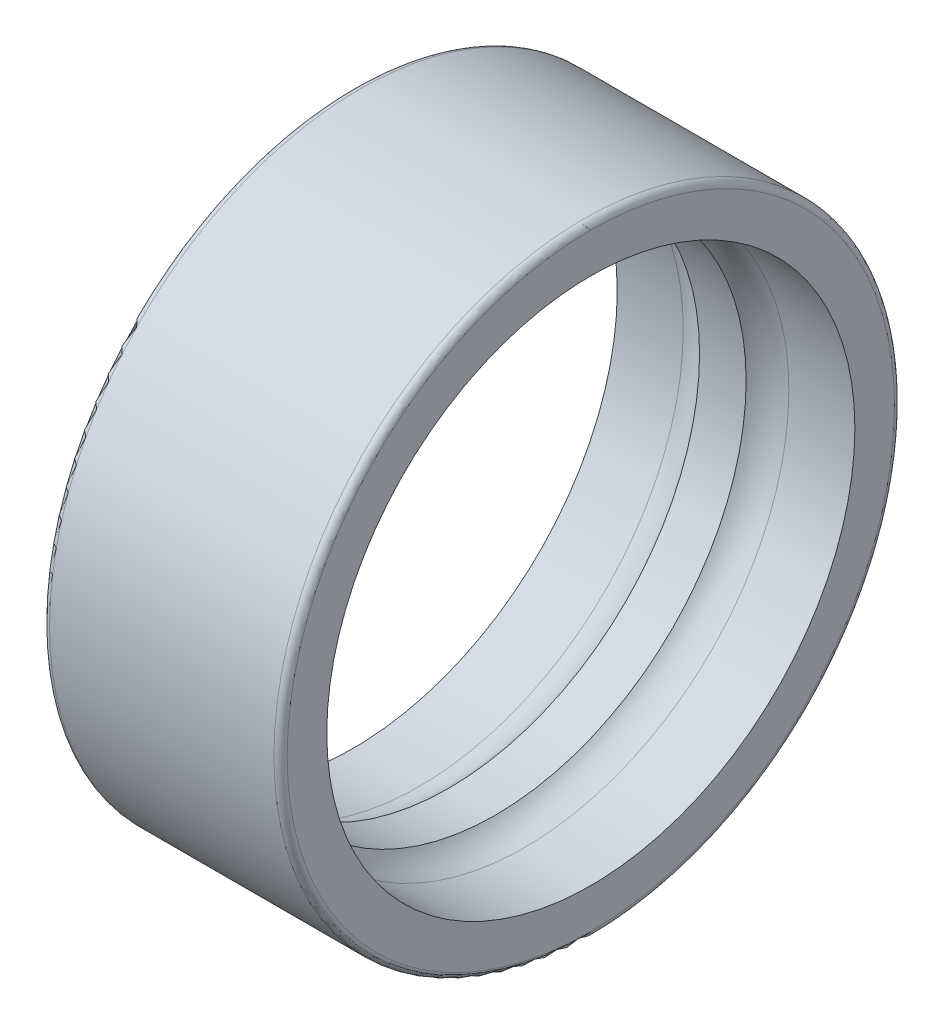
ISO-10303-21;
HEADER;
FILE_DESCRIPTION(('STEP AP214'),'2;1');
FILE_NAME('part.step','',(''),(''),'','','');
FILE_SCHEMA(('AUTOMOTIVE_DESIGN { 1 0 10303 214 1 1 1 1 }'));
ENDSEC;
DATA;
#1=APPLICATION_CONTEXT('core data for automotive mechanical design processes');
#2=APPLICATION_PROTOCOL_DEFINITION('international standard','automotive_design',2000,#1);
#3=PRODUCT_CONTEXT('',#1,'mechanical');
#4=PRODUCT('Part','Part','',(#3));
#5=PRODUCT_RELATED_PRODUCT_CATEGORY('part','',(#4));
#6=PRODUCT_DEFINITION_FORMATION('','',#4);
#7=PRODUCT_DEFINITION_CONTEXT('part definition',#1,'design');
#8=PRODUCT_DEFINITION('design','',#6,#7);
#9=PRODUCT_DEFINITION_SHAPE('','',#8);
#10=(LENGTH_UNIT() NAMED_UNIT(*) SI_UNIT(.MILLI.,.METRE.));
#11=(NAMED_UNIT(*) PLANE_ANGLE_UNIT() SI_UNIT($,.RADIAN.));
#12=(NAMED_UNIT(*) SI_UNIT($,.STERADIAN.) SOLID_ANGLE_UNIT());
#13=UNCERTAINTY_MEASURE_WITH_UNIT(LENGTH_MEASURE(1.E-05),#10,'distance_accuracy_value','');
#14=(GEOMETRIC_REPRESENTATION_CONTEXT(3) GLOBAL_UNCERTAINTY_ASSIGNED_CONTEXT((#13)) GLOBAL_UNIT_ASSIGNED_CONTEXT((#10,
#11,#12)) REPRESENTATION_CONTEXT('',''));
#15=CARTESIAN_POINT('',(0.,0.,0.));
#16=DIRECTION('',(0.,0.,1.));
#17=DIRECTION('',(1.,0.,0.));
#18=AXIS2_PLACEMENT_3D('',#15,#16,#17);
#19=CARTESIAN_POINT('',(-1.43955082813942,0.,0.));
#20=DIRECTION('',(-1.,0.,0.));
#21=DIRECTION('',(0.,0.,1.));
#22=AXIS2_PLACEMENT_3D('',#19,#20,#21);
#23=CYLINDRICAL_SURFACE('',#22,23.5);
#24=CARTESIAN_POINT('',(0.5,0.,0.));
#25=DIRECTION('',(1.,0.,0.));
#26=DIRECTION('',(0.,0.,-1.));
#27=AXIS2_PLACEMENT_3D('',#24,#25,#26);
#28=CIRCLE('',#27,23.5);
#29=CARTESIAN_POINT('',(0.5,0.,-23.5));
#30=VERTEX_POINT('',#29);
#31=EDGE_CURVE('E37',#30,#30,#28,.T.);
#32=ORIENTED_EDGE('',*,*,#31,.T.);
#33=EDGE_LOOP('',(#32));
#34=FACE_BOUND('',#33,.T.);
#35=CARTESIAN_POINT('',(17.5,0.,0.));
#36=DIRECTION('',(-1.,0.,0.));
#37=DIRECTION('',(0.,0.,1.));
#38=AXIS2_PLACEMENT_3D('',#35,#36,#37);
#39=CIRCLE('',#38,23.5);
#40=CARTESIAN_POINT('',(17.5,0.,23.5));
#41=VERTEX_POINT('',#40);
#42=EDGE_CURVE('E41',#41,#41,#39,.T.);
#43=ORIENTED_EDGE('',*,*,#42,.T.);
#44=EDGE_LOOP('',(#43));
#45=FACE_BOUND('',#44,.T.);
#46=ADVANCED_FACE('F30',(#34,#45),#23,.T.);
#47=CARTESIAN_POINT('',(0.,20.,0.));
#48=DIRECTION('',(1.,0.,0.));
#49=DIRECTION('',(0.,0.,-1.));
#50=AXIS2_PLACEMENT_3D('',#47,#48,#49);
#51=PLANE('',#50);
#52=CARTESIAN_POINT('',(0.,0.,0.));
#53=DIRECTION('',(1.,0.,0.));
#54=DIRECTION('',(0.,0.,-1.));
#55=AXIS2_PLACEMENT_3D('',#52,#53,#54);
#56=CIRCLE('',#55,23.);
#57=CARTESIAN_POINT('',(0.,0.,-23.));
#58=VERTEX_POINT('',#57);
#59=EDGE_CURVE('E45',#58,#58,#56,.F.);
#60=ORIENTED_EDGE('',*,*,#59,.T.);
#61=EDGE_LOOP('',(#60));
#62=FACE_BOUND('',#61,.T.);
#63=CARTESIAN_POINT('',(0.,0.,0.));
#64=DIRECTION('',(-1.,0.,0.));
#65=DIRECTION('',(0.,0.,1.));
#66=AXIS2_PLACEMENT_3D('',#63,#64,#65);
#67=CIRCLE('',#66,20.);
#68=CARTESIAN_POINT('',(0.,0.,20.));
#69=VERTEX_POINT('',#68);
#70=EDGE_CURVE('E50',#69,#69,#67,.T.);
#71=ORIENTED_EDGE('',*,*,#70,.F.);
#72=EDGE_LOOP('',(#71));
#73=FACE_BOUND('',#72,.T.);
#74=ADVANCED_FACE('F98',(#62,#73),#51,.F.);
#75=CARTESIAN_POINT('',(-1.43955082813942,0.,0.));
#76=DIRECTION('',(-1.,0.,0.));
#77=DIRECTION('',(0.,0.,1.));
#78=AXIS2_PLACEMENT_3D('',#75,#76,#77);
#79=CYLINDRICAL_SURFACE('',#78,20.);
#80=CARTESIAN_POINT('',(5.,0.,0.));
#81=DIRECTION('',(-1.,0.,0.));
#82=DIRECTION('',(0.,0.,1.));
#83=AXIS2_PLACEMENT_3D('',#80,#81,#82);
#84=CIRCLE('',#83,20.);
#85=CARTESIAN_POINT('',(5.,0.,20.));
#86=VERTEX_POINT('',#85);
#87=EDGE_CURVE('E53',#86,#86,#84,.T.);
#88=ORIENTED_EDGE('',*,*,#87,.F.);
#89=EDGE_LOOP('',(#88));
#90=FACE_BOUND('',#89,.T.);
#91=ORIENTED_EDGE('',*,*,#70,.T.);
#92=EDGE_LOOP('',(#91));
#93=FACE_BOUND('',#92,.T.);
#94=ADVANCED_FACE('F92',(#90,#93),#79,.F.);
#95=CARTESIAN_POINT('',(5.,0.,0.));
#96=DIRECTION('',(-1.,0.,0.));
#97=DIRECTION('',(0.,0.,1.));
#98=AXIS2_PLACEMENT_3D('',#95,#96,#97);
#99=TOROIDAL_SURFACE('',#98,17.,3.);
#100=CARTESIAN_POINT('',(7.23606797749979,0.,0.));
#101=DIRECTION('',(-1.,0.,0.));
#102=DIRECTION('',(0.,0.,1.));
#103=AXIS2_PLACEMENT_3D('',#100,#101,#102);
#104=CIRCLE('',#103,19.);
#105=CARTESIAN_POINT('',(7.23606797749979,0.,19.));
#106=VERTEX_POINT('',#105);
#107=EDGE_CURVE('E56',#106,#106,#104,.T.);
#108=ORIENTED_EDGE('',*,*,#107,.F.);
#109=EDGE_LOOP('',(#108));
#110=FACE_BOUND('',#109,.T.);
#111=ORIENTED_EDGE('',*,*,#87,.T.);
#112=EDGE_LOOP('',(#111));
#113=FACE_BOUND('',#112,.T.);
#114=ADVANCED_FACE('F86',(#110,#113),#99,.F.);
#115=CARTESIAN_POINT('',(-1.43955082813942,0.,0.));
#116=DIRECTION('',(-1.,0.,0.));
#117=DIRECTION('',(0.,0.,1.));
#118=AXIS2_PLACEMENT_3D('',#115,#116,#117);
#119=CYLINDRICAL_SURFACE('',#118,19.);
#120=CARTESIAN_POINT('',(10.7639320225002,0.,0.));
#121=DIRECTION('',(-1.,0.,0.));
#122=DIRECTION('',(0.,0.,1.));
#123=AXIS2_PLACEMENT_3D('',#120,#121,#122);
#124=CIRCLE('',#123,19.);
#125=CARTESIAN_POINT('',(10.7639320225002,0.,19.));
#126=VERTEX_POINT('',#125);
#127=EDGE_CURVE('E59',#126,#126,#124,.T.);
#128=ORIENTED_EDGE('',*,*,#127,.F.);
#129=EDGE_LOOP('',(#128));
#130=FACE_BOUND('',#129,.T.);
#131=ORIENTED_EDGE('',*,*,#107,.T.);
#132=EDGE_LOOP('',(#131));
#133=FACE_BOUND('',#132,.T.);
#134=ADVANCED_FACE('F80',(#130,#133),#119,.F.);
#135=CARTESIAN_POINT('',(13.,0.,0.));
#136=DIRECTION('',(-1.,0.,0.));
#137=DIRECTION('',(0.,0.,1.));
#138=AXIS2_PLACEMENT_3D('',#135,#136,#137);
#139=TOROIDAL_SURFACE('',#138,17.,3.);
#140=CARTESIAN_POINT('',(13.,0.,0.));
#141=DIRECTION('',(-1.,0.,0.));
#142=DIRECTION('',(0.,0.,1.));
#143=AXIS2_PLACEMENT_3D('',#140,#141,#142);
#144=CIRCLE('',#143,20.);
#145=CARTESIAN_POINT('',(13.,0.,20.));
#146=VERTEX_POINT('',#145);
#147=EDGE_CURVE('E62',#146,#146,#144,.T.);
#148=ORIENTED_EDGE('',*,*,#147,.F.);
#149=EDGE_LOOP('',(#148));
#150=FACE_BOUND('',#149,.T.);
#151=ORIENTED_EDGE('',*,*,#127,.T.);
#152=EDGE_LOOP('',(#151));
#153=FACE_BOUND('',#152,.T.);
#154=ADVANCED_FACE('F74',(#150,#153),#139,.F.);
#155=CARTESIAN_POINT('',(-1.43955082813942,0.,0.));
#156=DIRECTION('',(-1.,0.,0.));
#157=DIRECTION('',(0.,0.,1.));
#158=AXIS2_PLACEMENT_3D('',#155,#156,#157);
#159=CYLINDRICAL_SURFACE('',#158,20.);
#160=CARTESIAN_POINT('',(18.,0.,0.));
#161=DIRECTION('',(-1.,0.,0.));
#162=DIRECTION('',(0.,0.,1.));
#163=AXIS2_PLACEMENT_3D('',#160,#161,#162);
#164=CIRCLE('',#163,20.);
#165=CARTESIAN_POINT('',(18.,0.,20.));
#166=VERTEX_POINT('',#165);
#167=EDGE_CURVE('E65',#166,#166,#164,.T.);
#168=ORIENTED_EDGE('',*,*,#167,.F.);
#169=EDGE_LOOP('',(#168));
#170=FACE_BOUND('',#169,.T.);
#171=ORIENTED_EDGE('',*,*,#147,.T.);
#172=EDGE_LOOP('',(#171));
#173=FACE_BOUND('',#172,.T.);
#174=ADVANCED_FACE('F71',(#170,#173),#159,.F.);
#175=CARTESIAN_POINT('',(18.,23.5,0.));
#176=DIRECTION('',(-1.,0.,0.));
#177=DIRECTION('',(0.,0.,1.));
#178=AXIS2_PLACEMENT_3D('',#175,#176,#177);
#179=PLANE('',#178);
#180=CARTESIAN_POINT('',(18.,0.,0.));
#181=DIRECTION('',(-1.,0.,0.));
#182=DIRECTION('',(0.,0.,1.));
#183=AXIS2_PLACEMENT_3D('',#180,#181,#182);
#184=CIRCLE('',#183,23.);
#185=CARTESIAN_POINT('',(18.,0.,23.));
#186=VERTEX_POINT('',#185);
#187=EDGE_CURVE('E10',#186,#186,#184,.F.);
#188=ORIENTED_EDGE('',*,*,#187,.T.);
#189=EDGE_LOOP('',(#188));
#190=FACE_BOUND('',#189,.T.);
#191=ORIENTED_EDGE('',*,*,#167,.T.);
#192=EDGE_LOOP('',(#191));
#193=FACE_BOUND('',#192,.T.);
#194=ADVANCED_FACE('F69',(#190,#193),#179,.F.);
#195=CARTESIAN_POINT('',(0.5,0.,0.));
#196=DIRECTION('',(1.,0.,0.));
#197=DIRECTION('',(0.,0.,-1.));
#198=AXIS2_PLACEMENT_3D('',#195,#196,#197);
#199=TOROIDAL_SURFACE('',#198,23.,0.5);
#200=ORIENTED_EDGE('',*,*,#31,.F.);
#201=EDGE_LOOP('',(#200));
#202=FACE_BOUND('',#201,.T.);
#203=ORIENTED_EDGE('',*,*,#59,.F.);
#204=EDGE_LOOP('',(#203));
#205=FACE_BOUND('',#204,.T.);
#206=ADVANCED_FACE('F109',(#202,#205),#199,.T.);
#207=CARTESIAN_POINT('',(17.5,0.,0.));
#208=DIRECTION('',(-1.,0.,0.));
#209=DIRECTION('',(0.,0.,1.));
#210=AXIS2_PLACEMENT_3D('',#207,#208,#209);
#211=TOROIDAL_SURFACE('',#210,23.,0.5);
#212=ORIENTED_EDGE('',*,*,#187,.F.);
#213=EDGE_LOOP('',(#212));
#214=FACE_BOUND('',#213,.T.);
#215=ORIENTED_EDGE('',*,*,#42,.F.);
#216=EDGE_LOOP('',(#215));
#217=FACE_BOUND('',#216,.T.);
#218=ADVANCED_FACE('F32',(#214,#217),#211,.T.);
#219=CLOSED_SHELL('',(#46,#74,#94,#114,#134,#154,#174,#194,#206,#218));
#220=MANIFOLD_SOLID_BREP('B2',#219);
#221=ADVANCED_BREP_SHAPE_REPRESENTATION('',(#18,#220),#14);
#222=SHAPE_DEFINITION_REPRESENTATION(#9,#221);
ENDSEC;
END-ISO-10303-21;
